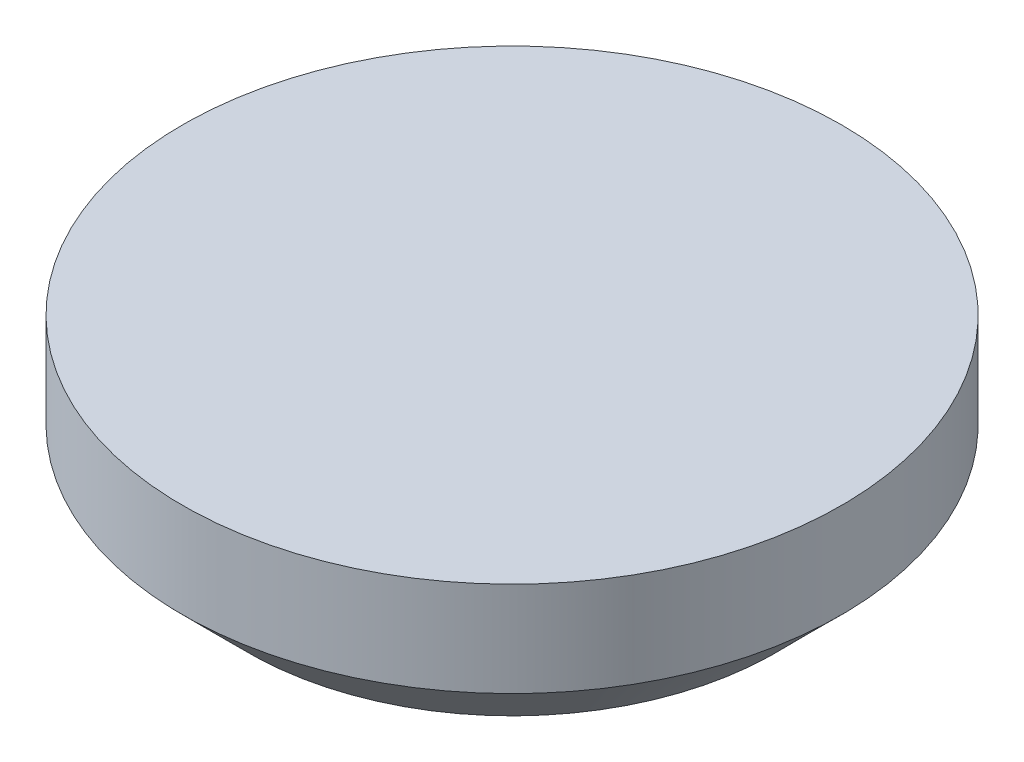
from build123d import *


with BuildPart() as part:
    # Sketch 1 → Revolve 1 (revolve)
    with BuildSketch(Plane.XY, mode=Mode.PRIVATE) as revolve_1_sk:
        Polygon((0, 390), (800, 390), (800, 160), (640, 0), (0, 0), align=None)
    revolve(revolve_1_sk.sketch.rotate(Axis((0, 0, 0), (0, 1, 0)), 90), axis=Axis((0, 0, 0), (0, 1, 0)))


solid = part.part
